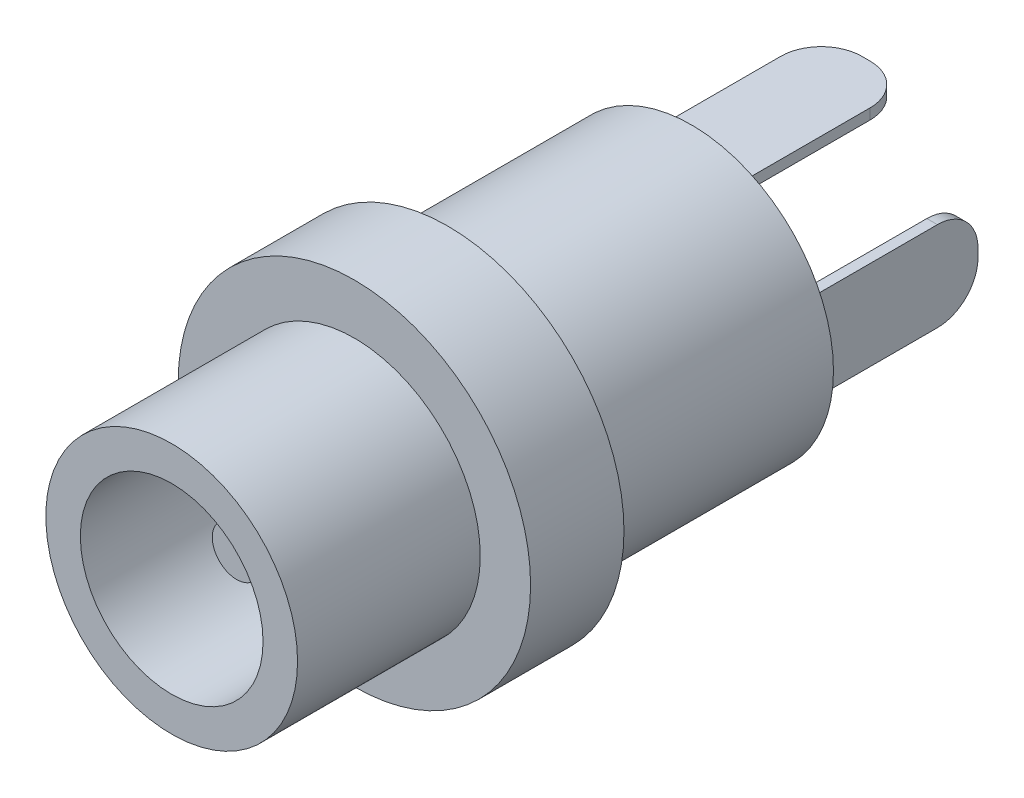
ISO-10303-21;
HEADER;
FILE_DESCRIPTION(('STEP AP214'),'2;1');
FILE_NAME('part.step','',(''),(''),'','','');
FILE_SCHEMA(('AUTOMOTIVE_DESIGN { 1 0 10303 214 1 1 1 1 }'));
ENDSEC;
DATA;
#1=APPLICATION_CONTEXT('core data for automotive mechanical design processes');
#2=APPLICATION_PROTOCOL_DEFINITION('international standard','automotive_design',2000,#1);
#3=PRODUCT_CONTEXT('',#1,'mechanical');
#4=PRODUCT('Part','Part','',(#3));
#5=PRODUCT_RELATED_PRODUCT_CATEGORY('part','',(#4));
#6=PRODUCT_DEFINITION_FORMATION('','',#4);
#7=PRODUCT_DEFINITION_CONTEXT('part definition',#1,'design');
#8=PRODUCT_DEFINITION('design','',#6,#7);
#9=PRODUCT_DEFINITION_SHAPE('','',#8);
#10=(LENGTH_UNIT() NAMED_UNIT(*) SI_UNIT(.MILLI.,.METRE.));
#11=(NAMED_UNIT(*) PLANE_ANGLE_UNIT() SI_UNIT($,.RADIAN.));
#12=(NAMED_UNIT(*) SI_UNIT($,.STERADIAN.) SOLID_ANGLE_UNIT());
#13=UNCERTAINTY_MEASURE_WITH_UNIT(LENGTH_MEASURE(1.E-05),#10,'distance_accuracy_value','');
#14=(GEOMETRIC_REPRESENTATION_CONTEXT(3) GLOBAL_UNCERTAINTY_ASSIGNED_CONTEXT((#13)) GLOBAL_UNIT_ASSIGNED_CONTEXT((#10,
#11,#12)) REPRESENTATION_CONTEXT('',''));
#15=CARTESIAN_POINT('',(0.,0.,0.));
#16=DIRECTION('',(0.,0.,1.));
#17=DIRECTION('',(1.,0.,0.));
#18=AXIS2_PLACEMENT_3D('',#15,#16,#17);
#19=CARTESIAN_POINT('',(0.,0.,3.175));
#20=DIRECTION('',(0.,0.,1.));
#21=DIRECTION('',(1.,0.,0.));
#22=AXIS2_PLACEMENT_3D('',#19,#20,#21);
#23=PLANE('',#22);
#24=CARTESIAN_POINT('',(0.,0.,3.175));
#25=DIRECTION('',(0.,0.,1.));
#26=DIRECTION('',(1.,0.,0.));
#27=AXIS2_PLACEMENT_3D('',#24,#25,#26);
#28=CIRCLE('',#27,2.8575);
#29=CARTESIAN_POINT('',(2.8575,0.,3.175));
#30=VERTEX_POINT('',#29);
#31=EDGE_CURVE('E179',#30,#30,#28,.T.);
#32=ORIENTED_EDGE('',*,*,#31,.T.);
#33=EDGE_LOOP('',(#32));
#34=FACE_BOUND('',#33,.T.);
#35=CARTESIAN_POINT('',(0.,0.,3.175));
#36=DIRECTION('',(0.,0.,1.));
#37=DIRECTION('',(1.,0.,0.));
#38=AXIS2_PLACEMENT_3D('',#35,#36,#37);
#39=CIRCLE('',#38,0.762);
#40=CARTESIAN_POINT('',(0.762,0.,3.175));
#41=VERTEX_POINT('',#40);
#42=EDGE_CURVE('E363',#41,#41,#39,.T.);
#43=ORIENTED_EDGE('',*,*,#42,.F.);
#44=EDGE_LOOP('',(#43));
#45=FACE_BOUND('',#44,.T.);
#46=ADVANCED_FACE('F34',(#34,#45),#23,.T.);
#47=CARTESIAN_POINT('',(0.,0.,-7.62));
#48=DIRECTION('',(0.,0.,-1.));
#49=DIRECTION('',(-1.,0.,0.));
#50=AXIS2_PLACEMENT_3D('',#47,#48,#49);
#51=PLANE('',#50);
#52=DIRECTION('',(-1.,0.,0.));
#53=VECTOR('',#52,1.);
#54=CARTESIAN_POINT('',(-3.17499999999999,-1.39700000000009,-7.61999999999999));
#55=LINE('',#54,#53);
#56=CARTESIAN_POINT('',(-3.17499999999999,-1.39700000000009,-7.61999999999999));
#57=VERTEX_POINT('',#56);
#58=CARTESIAN_POINT('',(-3.50519999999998,-1.39700000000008,-7.62));
#59=VERTEX_POINT('',#58);
#60=EDGE_CURVE('E202',#57,#59,#55,.T.);
#61=ORIENTED_EDGE('',*,*,#60,.F.);
#62=DIRECTION('',(0.,-1.,0.));
#63=VECTOR('',#62,1.);
#64=CARTESIAN_POINT('',(-3.17499999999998,1.39699999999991,-7.61999999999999));
#65=LINE('',#64,#63);
#66=CARTESIAN_POINT('',(-3.17499999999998,1.39699999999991,-7.61999999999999));
#67=VERTEX_POINT('',#66);
#68=EDGE_CURVE('E168',#67,#57,#65,.T.);
#69=ORIENTED_EDGE('',*,*,#68,.F.);
#70=DIRECTION('',(1.,0.,0.));
#71=VECTOR('',#70,1.);
#72=CARTESIAN_POINT('',(-3.17499999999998,1.39699999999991,-7.61999999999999));
#73=LINE('',#72,#71);
#74=CARTESIAN_POINT('',(-3.50519999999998,1.39699999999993,-7.62));
#75=VERTEX_POINT('',#74);
#76=EDGE_CURVE('E208',#75,#67,#73,.T.);
#77=ORIENTED_EDGE('',*,*,#76,.F.);
#78=DIRECTION('',(0.,1.,0.));
#79=VECTOR('',#78,1.);
#80=CARTESIAN_POINT('',(-3.50519999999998,1.39699999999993,-7.62));
#81=LINE('',#80,#79);
#82=EDGE_CURVE('E205',#59,#75,#81,.T.);
#83=ORIENTED_EDGE('',*,*,#82,.F.);
#84=EDGE_LOOP('',(#61,#69,#77,#83));
#85=FACE_BOUND('',#84,.T.);
#86=CARTESIAN_POINT('',(0.,0.,-7.62));
#87=DIRECTION('',(0.,0.,-1.));
#88=DIRECTION('',(-1.,0.,0.));
#89=AXIS2_PLACEMENT_3D('',#86,#87,#88);
#90=CIRCLE('',#89,4.445);
#91=CARTESIAN_POINT('',(4.445,0.,-7.62));
#92=VERTEX_POINT('',#91);
#93=EDGE_CURVE('E251',#92,#92,#90,.T.);
#94=ORIENTED_EDGE('',*,*,#93,.T.);
#95=EDGE_LOOP('',(#94));
#96=FACE_BOUND('',#95,.T.);
#97=DIRECTION('',(-1.,0.,0.));
#98=VECTOR('',#97,1.);
#99=CARTESIAN_POINT('',(1.39700000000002,3.175,-7.61999999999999));
#100=LINE('',#99,#98);
#101=CARTESIAN_POINT('',(1.39700000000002,3.175,-7.61999999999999));
#102=VERTEX_POINT('',#101);
#103=CARTESIAN_POINT('',(-1.397,3.175,-7.62));
#104=VERTEX_POINT('',#103);
#105=EDGE_CURVE('E228',#102,#104,#100,.T.);
#106=ORIENTED_EDGE('',*,*,#105,.F.);
#107=DIRECTION('',(0.,-1.,0.));
#108=VECTOR('',#107,1.);
#109=CARTESIAN_POINT('',(1.397,3.50520000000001,-7.61999999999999));
#110=LINE('',#109,#108);
#111=CARTESIAN_POINT('',(1.397,3.50520000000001,-7.61999999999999));
#112=VERTEX_POINT('',#111);
#113=EDGE_CURVE('E225',#112,#102,#110,.T.);
#114=ORIENTED_EDGE('',*,*,#113,.F.);
#115=DIRECTION('',(1.,0.,0.));
#116=VECTOR('',#115,1.);
#117=CARTESIAN_POINT('',(1.397,3.50520000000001,-7.61999999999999));
#118=LINE('',#117,#116);
#119=CARTESIAN_POINT('',(-1.39699999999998,3.50520000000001,-7.62));
#120=VERTEX_POINT('',#119);
#121=EDGE_CURVE('E234',#120,#112,#118,.T.);
#122=ORIENTED_EDGE('',*,*,#121,.F.);
#123=DIRECTION('',(0.,1.,0.));
#124=VECTOR('',#123,1.);
#125=CARTESIAN_POINT('',(-1.39699999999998,3.50520000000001,-7.62));
#126=LINE('',#125,#124);
#127=EDGE_CURVE('E231',#104,#120,#126,.T.);
#128=ORIENTED_EDGE('',*,*,#127,.F.);
#129=EDGE_LOOP('',(#106,#114,#122,#128));
#130=FACE_BOUND('',#129,.T.);
#131=DIRECTION('',(1.,0.,0.));
#132=VECTOR('',#131,1.);
#133=CARTESIAN_POINT('',(3.17500000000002,1.397,-7.62));
#134=LINE('',#133,#132);
#135=CARTESIAN_POINT('',(3.17500000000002,1.397,-7.62));
#136=VERTEX_POINT('',#135);
#137=CARTESIAN_POINT('',(3.50520000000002,1.397,-7.62));
#138=VERTEX_POINT('',#137);
#139=EDGE_CURVE('E163',#136,#138,#134,.T.);
#140=ORIENTED_EDGE('',*,*,#139,.F.);
#141=DIRECTION('',(0.,1.,0.));
#142=VECTOR('',#141,1.);
#143=CARTESIAN_POINT('',(3.17500000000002,1.397,-7.62));
#144=LINE('',#143,#142);
#145=CARTESIAN_POINT('',(3.17500000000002,-1.397,-7.62));
#146=VERTEX_POINT('',#145);
#147=EDGE_CURVE('E172',#146,#136,#144,.T.);
#148=ORIENTED_EDGE('',*,*,#147,.F.);
#149=DIRECTION('',(-1.,0.,0.));
#150=VECTOR('',#149,1.);
#151=CARTESIAN_POINT('',(3.17500000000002,-1.397,-7.62));
#152=LINE('',#151,#150);
#153=CARTESIAN_POINT('',(3.5052,-1.397,-7.62));
#154=VERTEX_POINT('',#153);
#155=EDGE_CURVE('E185',#154,#146,#152,.T.);
#156=ORIENTED_EDGE('',*,*,#155,.F.);
#157=DIRECTION('',(0.,-1.,0.));
#158=VECTOR('',#157,1.);
#159=CARTESIAN_POINT('',(3.50520000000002,1.397,-7.62));
#160=LINE('',#159,#158);
#161=EDGE_CURVE('E183',#138,#154,#160,.T.);
#162=ORIENTED_EDGE('',*,*,#161,.F.);
#163=EDGE_LOOP('',(#140,#148,#156,#162));
#164=FACE_BOUND('',#163,.T.);
#165=ADVANCED_FACE('F181',(#85,#96,#130,#164),#51,.T.);
#166=CARTESIAN_POINT('',(0.,0.,0.));
#167=DIRECTION('',(0.,0.,1.));
#168=DIRECTION('',(1.,0.,0.));
#169=AXIS2_PLACEMENT_3D('',#166,#167,#168);
#170=PLANE('',#169);
#171=CARTESIAN_POINT('',(0.,0.,0.));
#172=DIRECTION('',(0.,0.,1.));
#173=DIRECTION('',(1.,0.,0.));
#174=AXIS2_PLACEMENT_3D('',#171,#172,#173);
#175=CIRCLE('',#174,5.5118);
#176=CARTESIAN_POINT('',(5.5118,0.,0.));
#177=VERTEX_POINT('',#176);
#178=EDGE_CURVE('E260',#177,#177,#175,.T.);
#179=ORIENTED_EDGE('',*,*,#178,.F.);
#180=EDGE_LOOP('',(#179));
#181=FACE_BOUND('',#180,.T.);
#182=CARTESIAN_POINT('',(0.,0.,0.));
#183=DIRECTION('',(0.,0.,1.));
#184=DIRECTION('',(1.,0.,0.));
#185=AXIS2_PLACEMENT_3D('',#182,#183,#184);
#186=CIRCLE('',#185,4.445);
#187=CARTESIAN_POINT('',(4.445,0.,0.));
#188=VERTEX_POINT('',#187);
#189=EDGE_CURVE('E266',#188,#188,#186,.F.);
#190=ORIENTED_EDGE('',*,*,#189,.F.);
#191=EDGE_LOOP('',(#190));
#192=FACE_BOUND('',#191,.T.);
#193=ADVANCED_FACE('F345',(#181,#192),#170,.F.);
#194=CARTESIAN_POINT('',(0.,0.,2.92100000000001));
#195=DIRECTION('',(0.,0.,1.));
#196=DIRECTION('',(1.,0.,0.));
#197=AXIS2_PLACEMENT_3D('',#194,#195,#196);
#198=PLANE('',#197);
#199=CARTESIAN_POINT('',(0.,0.,2.92100000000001));
#200=DIRECTION('',(0.,0.,1.));
#201=DIRECTION('',(1.,0.,0.));
#202=AXIS2_PLACEMENT_3D('',#199,#200,#201);
#203=CIRCLE('',#202,5.5118);
#204=CARTESIAN_POINT('',(5.5118,0.,2.92100000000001));
#205=VERTEX_POINT('',#204);
#206=EDGE_CURVE('E263',#205,#205,#203,.T.);
#207=ORIENTED_EDGE('',*,*,#206,.T.);
#208=EDGE_LOOP('',(#207));
#209=FACE_BOUND('',#208,.T.);
#210=CARTESIAN_POINT('',(0.,0.,2.92100000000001));
#211=DIRECTION('',(0.,0.,1.));
#212=DIRECTION('',(1.,0.,0.));
#213=AXIS2_PLACEMENT_3D('',#210,#211,#212);
#214=CIRCLE('',#213,3.937);
#215=CARTESIAN_POINT('',(3.937,0.,2.92100000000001));
#216=VERTEX_POINT('',#215);
#217=EDGE_CURVE('E254',#216,#216,#214,.T.);
#218=ORIENTED_EDGE('',*,*,#217,.F.);
#219=EDGE_LOOP('',(#218));
#220=FACE_BOUND('',#219,.T.);
#221=ADVANCED_FACE('F386',(#209,#220),#198,.T.);
#222=CARTESIAN_POINT('',(0.,0.,2.92100000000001));
#223=DIRECTION('',(0.,0.,-1.));
#224=DIRECTION('',(-1.,0.,0.));
#225=AXIS2_PLACEMENT_3D('',#222,#223,#224);
#226=CYLINDRICAL_SURFACE('',#225,5.5118);
#227=ORIENTED_EDGE('',*,*,#206,.F.);
#228=EDGE_LOOP('',(#227));
#229=FACE_BOUND('',#228,.T.);
#230=ORIENTED_EDGE('',*,*,#178,.T.);
#231=EDGE_LOOP('',(#230));
#232=FACE_BOUND('',#231,.T.);
#233=ADVANCED_FACE('F36',(#229,#232),#226,.T.);
#234=CARTESIAN_POINT('',(0.,0.,8.636));
#235=DIRECTION('',(0.,0.,-1.));
#236=DIRECTION('',(-1.,0.,0.));
#237=AXIS2_PLACEMENT_3D('',#234,#235,#236);
#238=CYLINDRICAL_SURFACE('',#237,3.937);
#239=CARTESIAN_POINT('',(0.,0.,8.636));
#240=DIRECTION('',(0.,0.,1.));
#241=DIRECTION('',(1.,0.,0.));
#242=AXIS2_PLACEMENT_3D('',#239,#240,#241);
#243=CIRCLE('',#242,3.937);
#244=CARTESIAN_POINT('',(3.937,0.,8.636));
#245=VERTEX_POINT('',#244);
#246=EDGE_CURVE('E257',#245,#245,#243,.T.);
#247=ORIENTED_EDGE('',*,*,#246,.F.);
#248=EDGE_LOOP('',(#247));
#249=FACE_BOUND('',#248,.T.);
#250=ORIENTED_EDGE('',*,*,#217,.T.);
#251=EDGE_LOOP('',(#250));
#252=FACE_BOUND('',#251,.T.);
#253=ADVANCED_FACE('F377',(#249,#252),#238,.T.);
#254=CARTESIAN_POINT('',(0.,0.,8.636));
#255=DIRECTION('',(0.,0.,1.));
#256=DIRECTION('',(1.,0.,0.));
#257=AXIS2_PLACEMENT_3D('',#254,#255,#256);
#258=PLANE('',#257);
#259=CARTESIAN_POINT('',(0.,0.,8.636));
#260=DIRECTION('',(0.,0.,1.));
#261=DIRECTION('',(1.,0.,0.));
#262=AXIS2_PLACEMENT_3D('',#259,#260,#261);
#263=CIRCLE('',#262,2.8575);
#264=CARTESIAN_POINT('',(2.8575,0.,8.636));
#265=VERTEX_POINT('',#264);
#266=EDGE_CURVE('E362',#265,#265,#263,.T.);
#267=ORIENTED_EDGE('',*,*,#266,.F.);
#268=EDGE_LOOP('',(#267));
#269=FACE_BOUND('',#268,.T.);
#270=ORIENTED_EDGE('',*,*,#246,.T.);
#271=EDGE_LOOP('',(#270));
#272=FACE_BOUND('',#271,.T.);
#273=ADVANCED_FACE('F373',(#269,#272),#258,.T.);
#274=CARTESIAN_POINT('',(0.,0.,-7.62));
#275=DIRECTION('',(0.,0.,1.));
#276=DIRECTION('',(1.,0.,0.));
#277=AXIS2_PLACEMENT_3D('',#274,#275,#276);
#278=CYLINDRICAL_SURFACE('',#277,4.445);
#279=CARTESIAN_POINT('',(4.445,0.,-7.62));
#280=CARTESIAN_POINT('',(4.445,0.,-7.540625));
#281=CARTESIAN_POINT('',(4.445,0.,-7.46125));
#282=CARTESIAN_POINT('',(4.445,0.,-7.3025));
#283=CARTESIAN_POINT('',(4.445,0.,-7.223125));
#284=CARTESIAN_POINT('',(4.445,0.,-7.064375));
#285=CARTESIAN_POINT('',(4.445,0.,-6.985));
#286=CARTESIAN_POINT('',(4.445,0.,-6.82625));
#287=CARTESIAN_POINT('',(4.445,0.,-6.746875));
#288=CARTESIAN_POINT('',(4.445,0.,-6.588125));
#289=CARTESIAN_POINT('',(4.445,0.,-6.50875));
#290=CARTESIAN_POINT('',(4.445,0.,-6.35));
#291=CARTESIAN_POINT('',(4.445,0.,-6.270625));
#292=CARTESIAN_POINT('',(4.445,0.,-6.111875));
#293=CARTESIAN_POINT('',(4.445,0.,-6.0325));
#294=CARTESIAN_POINT('',(4.445,0.,-5.87375));
#295=CARTESIAN_POINT('',(4.445,0.,-5.794375));
#296=CARTESIAN_POINT('',(4.445,0.,-5.635625));
#297=CARTESIAN_POINT('',(4.445,0.,-5.55625));
#298=CARTESIAN_POINT('',(4.445,0.,-5.3975));
#299=CARTESIAN_POINT('',(4.445,0.,-5.318125));
#300=CARTESIAN_POINT('',(4.445,0.,-5.159375));
#301=CARTESIAN_POINT('',(4.445,0.,-5.08));
#302=CARTESIAN_POINT('',(4.445,0.,-4.92125));
#303=CARTESIAN_POINT('',(4.445,0.,-4.841875));
#304=CARTESIAN_POINT('',(4.445,0.,-4.683125));
#305=CARTESIAN_POINT('',(4.445,0.,-4.60375));
#306=CARTESIAN_POINT('',(4.445,0.,-4.445));
#307=CARTESIAN_POINT('',(4.445,0.,-4.365625));
#308=CARTESIAN_POINT('',(4.445,0.,-4.206875));
#309=CARTESIAN_POINT('',(4.445,0.,-4.1275));
#310=CARTESIAN_POINT('',(4.445,0.,-3.96875));
#311=CARTESIAN_POINT('',(4.445,0.,-3.889375));
#312=CARTESIAN_POINT('',(4.445,0.,-3.730625));
#313=CARTESIAN_POINT('',(4.445,0.,-3.65125));
#314=CARTESIAN_POINT('',(4.445,0.,-3.4925));
#315=CARTESIAN_POINT('',(4.445,0.,-3.413125));
#316=CARTESIAN_POINT('',(4.445,0.,-3.254375));
#317=CARTESIAN_POINT('',(4.445,0.,-3.175));
#318=CARTESIAN_POINT('',(4.445,0.,-3.01625));
#319=CARTESIAN_POINT('',(4.445,0.,-2.936875));
#320=CARTESIAN_POINT('',(4.445,0.,-2.778125));
#321=CARTESIAN_POINT('',(4.445,0.,-2.69875));
#322=CARTESIAN_POINT('',(4.445,0.,-2.54));
#323=CARTESIAN_POINT('',(4.445,0.,-2.460625));
#324=CARTESIAN_POINT('',(4.445,0.,-2.301875));
#325=CARTESIAN_POINT('',(4.445,0.,-2.2225));
#326=CARTESIAN_POINT('',(4.445,0.,-2.06375));
#327=CARTESIAN_POINT('',(4.445,0.,-1.984375));
#328=CARTESIAN_POINT('',(4.445,0.,-1.825625));
#329=CARTESIAN_POINT('',(4.445,0.,-1.74625));
#330=CARTESIAN_POINT('',(4.445,0.,-1.5875));
#331=CARTESIAN_POINT('',(4.445,0.,-1.508125));
#332=CARTESIAN_POINT('',(4.445,0.,-1.349375));
#333=CARTESIAN_POINT('',(4.445,0.,-1.27));
#334=CARTESIAN_POINT('',(4.445,0.,-1.11125));
#335=CARTESIAN_POINT('',(4.445,0.,-1.031875));
#336=CARTESIAN_POINT('',(4.445,0.,-0.873125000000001));
#337=CARTESIAN_POINT('',(4.445,0.,-0.793750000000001));
#338=CARTESIAN_POINT('',(4.445,0.,-0.635000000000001));
#339=CARTESIAN_POINT('',(4.445,0.,-0.555625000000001));
#340=CARTESIAN_POINT('',(4.445,0.,-0.396875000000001));
#341=CARTESIAN_POINT('',(4.445,0.,-0.317500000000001));
#342=CARTESIAN_POINT('',(4.445,0.,-0.158750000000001));
#343=CARTESIAN_POINT('',(4.445,0.,-0.0793750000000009));
#344=CARTESIAN_POINT('',(4.445,0.,0.));
#345=B_SPLINE_CURVE_WITH_KNOTS('',3,(#279,#280,#281,#282,#283,#284,#285,#286,#287,#288,#289,
#290,#291,#292,#293,#294,#295,#296,#297,#298,#299,#300,#301,#302,#303,#304,#305,#306,#307,#308,
#309,#310,#311,#312,#313,#314,#315,#316,#317,#318,#319,#320,#321,#322,#323,#324,#325,#326,#327,
#328,#329,#330,#331,#332,#333,#334,#335,#336,#337,#338,#339,#340,#341,#342,#343,#344),
.UNSPECIFIED.,.F.,.F.,(4,2,2,2,2,2,2,2,2,2,2,2,2,2,2,2,2,2,2,2,2,2,2,2,2,2,2,2,2,2,2,2,4),(0.,
0.238125,0.47625,0.714375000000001,0.9525,1.190625,1.42875,1.666875,1.905,2.143125,2.38125,
2.619375,2.8575,3.095625,3.33375,3.571875,3.81,4.048125,4.28625,4.524375,4.7625,5.000625,
5.23875,5.476875,5.715,5.953125,6.19125,6.429375,6.6675,6.905625,7.14375,7.381875,7.62),.UNSPECIFIED.);
#346=EDGE_CURVE('BSEAM376',#92,#188,#345,.T.);
#347=ORIENTED_EDGE('',*,*,#93,.F.);
#348=ORIENTED_EDGE('',*,*,#189,.T.);
#349=ORIENTED_EDGE('',*,*,#346,.T.);
#350=ORIENTED_EDGE('',*,*,#346,.F.);
#351=EDGE_LOOP('',(#347,#349,#348,#350));
#352=FACE_BOUND('',#351,.T.);
#353=ADVANCED_FACE('F376',(#352),#278,.T.);
#354=CARTESIAN_POINT('',(1.397,3.50520000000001,-13.081));
#355=DIRECTION('',(-1.,0.,0.));
#356=DIRECTION('',(0.,0.,1.));
#357=AXIS2_PLACEMENT_3D('',#354,#355,#356);
#358=PLANE('',#357);
#359=DIRECTION('',(0.,0.,1.));
#360=VECTOR('',#359,1.);
#361=CARTESIAN_POINT('',(1.39700000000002,3.175,-13.081));
#362=LINE('',#361,#360);
#363=CARTESIAN_POINT('',(1.39700000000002,3.175,-11.811));
#364=VERTEX_POINT('',#363);
#365=EDGE_CURVE('E249',#364,#102,#362,.T.);
#366=ORIENTED_EDGE('',*,*,#365,.F.);
#367=DIRECTION('',(0.,-1.,0.));
#368=VECTOR('',#367,1.);
#369=CARTESIAN_POINT('',(1.397,3.50520000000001,-11.811));
#370=LINE('',#369,#368);
#371=CARTESIAN_POINT('',(1.397,3.50520000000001,-11.811));
#372=VERTEX_POINT('',#371);
#373=EDGE_CURVE('E279',#364,#372,#370,.F.);
#374=ORIENTED_EDGE('',*,*,#373,.T.);
#375=DIRECTION('',(0.,0.,1.));
#376=VECTOR('',#375,1.);
#377=CARTESIAN_POINT('',(1.397,3.50520000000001,-13.081));
#378=LINE('',#377,#376);
#379=EDGE_CURVE('E243',#372,#112,#378,.T.);
#380=ORIENTED_EDGE('',*,*,#379,.T.);
#381=ORIENTED_EDGE('',*,*,#113,.T.);
#382=EDGE_LOOP('',(#366,#374,#380,#381));
#383=FACE_BOUND('',#382,.T.);
#384=ADVANCED_FACE('F398',(#383),#358,.F.);
#385=CARTESIAN_POINT('',(1.39700000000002,3.175,-13.081));
#386=DIRECTION('',(0.,1.,0.));
#387=DIRECTION('',(-1.,0.,0.));
#388=AXIS2_PLACEMENT_3D('',#385,#386,#387);
#389=PLANE('',#388);
#390=DIRECTION('',(-1.,0.,0.));
#391=VECTOR('',#390,1.);
#392=CARTESIAN_POINT('',(1.39700000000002,3.175,-13.081));
#393=LINE('',#392,#391);
#394=CARTESIAN_POINT('',(0.127000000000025,3.17499999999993,-13.081));
#395=VERTEX_POINT('',#394);
#396=CARTESIAN_POINT('',(-0.12699999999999,3.17499999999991,-13.081));
#397=VERTEX_POINT('',#396);
#398=EDGE_CURVE('E237',#395,#397,#393,.T.);
#399=ORIENTED_EDGE('',*,*,#398,.F.);
#400=CARTESIAN_POINT('',(0.127000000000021,3.17499999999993,-11.811));
#401=DIRECTION('',(0.,1.,0.));
#402=DIRECTION('',(-1.,0.,0.));
#403=AXIS2_PLACEMENT_3D('',#400,#401,#402);
#404=CIRCLE('',#403,1.27);
#405=EDGE_CURVE('E277',#395,#364,#404,.F.);
#406=ORIENTED_EDGE('',*,*,#405,.T.);
#407=ORIENTED_EDGE('',*,*,#365,.T.);
#408=ORIENTED_EDGE('',*,*,#105,.T.);
#409=DIRECTION('',(0.,0.,1.));
#410=VECTOR('',#409,1.);
#411=CARTESIAN_POINT('',(-1.397,3.175,-13.081));
#412=LINE('',#411,#410);
#413=CARTESIAN_POINT('',(-1.397,3.175,-11.811));
#414=VERTEX_POINT('',#413);
#415=EDGE_CURVE('E247',#414,#104,#412,.T.);
#416=ORIENTED_EDGE('',*,*,#415,.F.);
#417=CARTESIAN_POINT('',(-0.12699999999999,3.17499999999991,-11.811));
#418=DIRECTION('',(0.,1.,0.));
#419=DIRECTION('',(-1.,0.,0.));
#420=AXIS2_PLACEMENT_3D('',#417,#418,#419);
#421=CIRCLE('',#420,1.27);
#422=EDGE_CURVE('E275',#414,#397,#421,.F.);
#423=ORIENTED_EDGE('',*,*,#422,.T.);
#424=EDGE_LOOP('',(#399,#406,#407,#408,#416,#423));
#425=FACE_BOUND('',#424,.T.);
#426=ADVANCED_FACE('F403',(#425),#389,.F.);
#427=CARTESIAN_POINT('',(-1.39699999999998,3.50520000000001,-13.081));
#428=DIRECTION('',(1.,0.,0.));
#429=DIRECTION('',(0.,0.,-1.));
#430=AXIS2_PLACEMENT_3D('',#427,#428,#429);
#431=PLANE('',#430);
#432=DIRECTION('',(0.,0.,1.));
#433=VECTOR('',#432,1.);
#434=CARTESIAN_POINT('',(-1.39699999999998,3.50520000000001,-13.081));
#435=LINE('',#434,#433);
#436=CARTESIAN_POINT('',(-1.39699999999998,3.50520000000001,-11.811));
#437=VERTEX_POINT('',#436);
#438=EDGE_CURVE('E245',#437,#120,#435,.T.);
#439=ORIENTED_EDGE('',*,*,#438,.F.);
#440=DIRECTION('',(0.,1.,0.));
#441=VECTOR('',#440,1.);
#442=CARTESIAN_POINT('',(-1.397,3.175,-11.811));
#443=LINE('',#442,#441);
#444=EDGE_CURVE('E285',#437,#414,#443,.F.);
#445=ORIENTED_EDGE('',*,*,#444,.T.);
#446=ORIENTED_EDGE('',*,*,#415,.T.);
#447=ORIENTED_EDGE('',*,*,#127,.T.);
#448=EDGE_LOOP('',(#439,#445,#446,#447));
#449=FACE_BOUND('',#448,.T.);
#450=ADVANCED_FACE('F407',(#449),#431,.F.);
#451=CARTESIAN_POINT('',(1.397,3.50520000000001,-13.081));
#452=DIRECTION('',(0.,-1.,0.));
#453=DIRECTION('',(1.,0.,0.));
#454=AXIS2_PLACEMENT_3D('',#451,#452,#453);
#455=PLANE('',#454);
#456=ORIENTED_EDGE('',*,*,#379,.F.);
#457=CARTESIAN_POINT('',(0.127000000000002,3.5052,-11.811));
#458=DIRECTION('',(0.,-1.,0.));
#459=DIRECTION('',(1.,0.,0.));
#460=AXIS2_PLACEMENT_3D('',#457,#458,#459);
#461=CIRCLE('',#460,1.27);
#462=CARTESIAN_POINT('',(0.127000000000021,3.5052,-13.081));
#463=VERTEX_POINT('',#462);
#464=EDGE_CURVE('E283',#372,#463,#461,.F.);
#465=ORIENTED_EDGE('',*,*,#464,.T.);
#466=DIRECTION('',(1.,0.,0.));
#467=VECTOR('',#466,1.);
#468=CARTESIAN_POINT('',(1.397,3.50520000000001,-13.081));
#469=LINE('',#468,#467);
#470=CARTESIAN_POINT('',(-0.126999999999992,3.50519999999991,-13.081));
#471=VERTEX_POINT('',#470);
#472=EDGE_CURVE('E240',#471,#463,#469,.T.);
#473=ORIENTED_EDGE('',*,*,#472,.F.);
#474=CARTESIAN_POINT('',(-0.126999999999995,3.50519999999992,-11.811));
#475=DIRECTION('',(0.,-1.,0.));
#476=DIRECTION('',(1.,0.,0.));
#477=AXIS2_PLACEMENT_3D('',#474,#475,#476);
#478=CIRCLE('',#477,1.27);
#479=EDGE_CURVE('E281',#471,#437,#478,.F.);
#480=ORIENTED_EDGE('',*,*,#479,.T.);
#481=ORIENTED_EDGE('',*,*,#438,.T.);
#482=ORIENTED_EDGE('',*,*,#121,.T.);
#483=EDGE_LOOP('',(#456,#465,#473,#480,#481,#482));
#484=FACE_BOUND('',#483,.T.);
#485=ADVANCED_FACE('F411',(#484),#455,.F.);
#486=CARTESIAN_POINT('',(1.39700000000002,3.175,-13.081));
#487=DIRECTION('',(0.,0.,-1.));
#488=DIRECTION('',(-1.,0.,0.));
#489=AXIS2_PLACEMENT_3D('',#486,#487,#488);
#490=PLANE('',#489);
#491=ORIENTED_EDGE('',*,*,#472,.T.);
#492=DIRECTION('',(0.,-1.,0.));
#493=VECTOR('',#492,1.);
#494=CARTESIAN_POINT('',(0.127000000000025,3.17499999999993,-13.081));
#495=LINE('',#494,#493);
#496=EDGE_CURVE('E272',#463,#395,#495,.T.);
#497=ORIENTED_EDGE('',*,*,#496,.T.);
#498=ORIENTED_EDGE('',*,*,#398,.T.);
#499=DIRECTION('',(0.,1.,0.));
#500=VECTOR('',#499,1.);
#501=CARTESIAN_POINT('',(-0.126999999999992,3.50519999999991,-13.081));
#502=LINE('',#501,#500);
#503=EDGE_CURVE('E269',#397,#471,#502,.T.);
#504=ORIENTED_EDGE('',*,*,#503,.T.);
#505=EDGE_LOOP('',(#491,#497,#498,#504));
#506=FACE_BOUND('',#505,.T.);
#507=ADVANCED_FACE('F415',(#506),#490,.T.);
#508=CARTESIAN_POINT('',(-3.17499999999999,1.39699999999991,-13.081));
#509=DIRECTION('',(-1.,0.,0.));
#510=DIRECTION('',(0.,-1.,0.));
#511=AXIS2_PLACEMENT_3D('',#508,#509,#510);
#512=PLANE('',#511);
#513=DIRECTION('',(0.,-1.,0.));
#514=VECTOR('',#513,1.);
#515=CARTESIAN_POINT('',(-3.17499999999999,1.39699999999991,-13.081));
#516=LINE('',#515,#514);
#517=CARTESIAN_POINT('',(-3.17499999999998,0.127000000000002,-13.081));
#518=VERTEX_POINT('',#517);
#519=CARTESIAN_POINT('',(-3.17499999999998,-0.126999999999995,-13.081));
#520=VERTEX_POINT('',#519);
#521=EDGE_CURVE('E211',#518,#520,#516,.T.);
#522=ORIENTED_EDGE('',*,*,#521,.F.);
#523=CARTESIAN_POINT('',(-3.17499999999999,0.127000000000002,-11.811));
#524=DIRECTION('',(-1.,0.,0.));
#525=DIRECTION('',(0.,-1.,0.));
#526=AXIS2_PLACEMENT_3D('',#523,#524,#525);
#527=CIRCLE('',#526,1.27);
#528=CARTESIAN_POINT('',(-3.17499999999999,1.39699999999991,-11.811));
#529=VERTEX_POINT('',#528);
#530=EDGE_CURVE('E295',#518,#529,#527,.F.);
#531=ORIENTED_EDGE('',*,*,#530,.T.);
#532=DIRECTION('',(0.,0.,1.));
#533=VECTOR('',#532,1.);
#534=CARTESIAN_POINT('',(-3.17499999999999,1.39699999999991,-13.081));
#535=LINE('',#534,#533);
#536=EDGE_CURVE('E217',#529,#67,#535,.T.);
#537=ORIENTED_EDGE('',*,*,#536,.T.);
#538=ORIENTED_EDGE('',*,*,#68,.T.);
#539=DIRECTION('',(0.,0.,1.));
#540=VECTOR('',#539,1.);
#541=CARTESIAN_POINT('',(-3.17499999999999,-1.39700000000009,-13.081));
#542=LINE('',#541,#540);
#543=CARTESIAN_POINT('',(-3.175,-1.39700000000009,-11.811));
#544=VERTEX_POINT('',#543);
#545=EDGE_CURVE('E223',#544,#57,#542,.T.);
#546=ORIENTED_EDGE('',*,*,#545,.F.);
#547=CARTESIAN_POINT('',(-3.17499999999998,-0.126999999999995,-11.811));
#548=DIRECTION('',(-1.,0.,0.));
#549=DIRECTION('',(0.,-1.,0.));
#550=AXIS2_PLACEMENT_3D('',#547,#548,#549);
#551=CIRCLE('',#550,1.27);
#552=EDGE_CURVE('E293',#544,#520,#551,.F.);
#553=ORIENTED_EDGE('',*,*,#552,.T.);
#554=EDGE_LOOP('',(#522,#531,#537,#538,#546,#553));
#555=FACE_BOUND('',#554,.T.);
#556=ADVANCED_FACE('F419',(#555),#512,.F.);
#557=CARTESIAN_POINT('',(-3.17499999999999,-1.39700000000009,-13.081));
#558=DIRECTION('',(0.,1.,0.));
#559=DIRECTION('',(0.,0.,1.));
#560=AXIS2_PLACEMENT_3D('',#557,#558,#559);
#561=PLANE('',#560);
#562=DIRECTION('',(0.,0.,1.));
#563=VECTOR('',#562,1.);
#564=CARTESIAN_POINT('',(-3.50519999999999,-1.39700000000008,-13.081));
#565=LINE('',#564,#563);
#566=CARTESIAN_POINT('',(-3.50519999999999,-1.39700000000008,-11.811));
#567=VERTEX_POINT('',#566);
#568=EDGE_CURVE('E221',#567,#59,#565,.T.);
#569=ORIENTED_EDGE('',*,*,#568,.F.);
#570=DIRECTION('',(-1.,0.,0.));
#571=VECTOR('',#570,1.);
#572=CARTESIAN_POINT('',(-3.175,-1.39700000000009,-11.811));
#573=LINE('',#572,#571);
#574=EDGE_CURVE('E303',#567,#544,#573,.F.);
#575=ORIENTED_EDGE('',*,*,#574,.T.);
#576=ORIENTED_EDGE('',*,*,#545,.T.);
#577=ORIENTED_EDGE('',*,*,#60,.T.);
#578=EDGE_LOOP('',(#569,#575,#576,#577));
#579=FACE_BOUND('',#578,.T.);
#580=ADVANCED_FACE('F423',(#579),#561,.F.);
#581=CARTESIAN_POINT('',(-3.50519999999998,1.39699999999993,-13.081));
#582=DIRECTION('',(1.,0.,0.));
#583=DIRECTION('',(0.,1.,0.));
#584=AXIS2_PLACEMENT_3D('',#581,#582,#583);
#585=PLANE('',#584);
#586=DIRECTION('',(0.,0.,1.));
#587=VECTOR('',#586,1.);
#588=CARTESIAN_POINT('',(-3.50519999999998,1.39699999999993,-13.081));
#589=LINE('',#588,#587);
#590=CARTESIAN_POINT('',(-3.50519999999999,1.39699999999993,-11.811));
#591=VERTEX_POINT('',#590);
#592=EDGE_CURVE('E219',#591,#75,#589,.T.);
#593=ORIENTED_EDGE('',*,*,#592,.F.);
#594=CARTESIAN_POINT('',(-3.50519999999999,0.127000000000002,-11.811));
#595=DIRECTION('',(1.,0.,0.));
#596=DIRECTION('',(0.,1.,0.));
#597=AXIS2_PLACEMENT_3D('',#594,#595,#596);
#598=CIRCLE('',#597,1.27);
#599=CARTESIAN_POINT('',(-3.50519999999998,0.127000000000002,-13.081));
#600=VERTEX_POINT('',#599);
#601=EDGE_CURVE('E301',#591,#600,#598,.F.);
#602=ORIENTED_EDGE('',*,*,#601,.T.);
#603=DIRECTION('',(0.,1.,0.));
#604=VECTOR('',#603,1.);
#605=CARTESIAN_POINT('',(-3.50519999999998,1.39699999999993,-13.081));
#606=LINE('',#605,#604);
#607=CARTESIAN_POINT('',(-3.5052,-0.127000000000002,-13.081));
#608=VERTEX_POINT('',#607);
#609=EDGE_CURVE('E214',#608,#600,#606,.T.);
#610=ORIENTED_EDGE('',*,*,#609,.F.);
#611=CARTESIAN_POINT('',(-3.5052,-0.127000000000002,-11.811));
#612=DIRECTION('',(1.,0.,0.));
#613=DIRECTION('',(0.,1.,0.));
#614=AXIS2_PLACEMENT_3D('',#611,#612,#613);
#615=CIRCLE('',#614,1.27);
#616=EDGE_CURVE('E299',#608,#567,#615,.F.);
#617=ORIENTED_EDGE('',*,*,#616,.T.);
#618=ORIENTED_EDGE('',*,*,#568,.T.);
#619=ORIENTED_EDGE('',*,*,#82,.T.);
#620=EDGE_LOOP('',(#593,#602,#610,#617,#618,#619));
#621=FACE_BOUND('',#620,.T.);
#622=ADVANCED_FACE('F427',(#621),#585,.F.);
#623=CARTESIAN_POINT('',(-3.17499999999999,1.39699999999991,-13.081));
#624=DIRECTION('',(0.,-1.,0.));
#625=DIRECTION('',(0.,0.,-1.));
#626=AXIS2_PLACEMENT_3D('',#623,#624,#625);
#627=PLANE('',#626);
#628=ORIENTED_EDGE('',*,*,#536,.F.);
#629=DIRECTION('',(1.,0.,0.));
#630=VECTOR('',#629,1.);
#631=CARTESIAN_POINT('',(-3.50519999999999,1.39699999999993,-11.811));
#632=LINE('',#631,#630);
#633=EDGE_CURVE('E297',#529,#591,#632,.F.);
#634=ORIENTED_EDGE('',*,*,#633,.T.);
#635=ORIENTED_EDGE('',*,*,#592,.T.);
#636=ORIENTED_EDGE('',*,*,#76,.T.);
#637=EDGE_LOOP('',(#628,#634,#635,#636));
#638=FACE_BOUND('',#637,.T.);
#639=ADVANCED_FACE('F431',(#638),#627,.F.);
#640=CARTESIAN_POINT('',(-3.17499999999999,-1.39700000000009,-13.081));
#641=DIRECTION('',(0.,0.,-1.));
#642=DIRECTION('',(-1.,0.,0.));
#643=AXIS2_PLACEMENT_3D('',#640,#641,#642);
#644=PLANE('',#643);
#645=ORIENTED_EDGE('',*,*,#609,.T.);
#646=DIRECTION('',(1.,0.,0.));
#647=VECTOR('',#646,1.);
#648=CARTESIAN_POINT('',(-3.17499999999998,0.127000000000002,-13.081));
#649=LINE('',#648,#647);
#650=EDGE_CURVE('E290',#600,#518,#649,.T.);
#651=ORIENTED_EDGE('',*,*,#650,.T.);
#652=ORIENTED_EDGE('',*,*,#521,.T.);
#653=DIRECTION('',(-1.,0.,0.));
#654=VECTOR('',#653,1.);
#655=CARTESIAN_POINT('',(-3.5052,-0.127000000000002,-13.081));
#656=LINE('',#655,#654);
#657=EDGE_CURVE('E287',#520,#608,#656,.T.);
#658=ORIENTED_EDGE('',*,*,#657,.T.);
#659=EDGE_LOOP('',(#645,#651,#652,#658));
#660=FACE_BOUND('',#659,.T.);
#661=ADVANCED_FACE('F435',(#660),#644,.T.);
#662=CARTESIAN_POINT('',(3.17500000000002,1.397,-13.081));
#663=DIRECTION('',(1.,0.,0.));
#664=DIRECTION('',(0.,0.,-1.));
#665=AXIS2_PLACEMENT_3D('',#662,#663,#664);
#666=PLANE('',#665);
#667=DIRECTION('',(0.,1.,0.));
#668=VECTOR('',#667,1.);
#669=CARTESIAN_POINT('',(3.17500000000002,1.397,-13.081));
#670=LINE('',#669,#668);
#671=CARTESIAN_POINT('',(3.175,-0.126999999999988,-13.081));
#672=VERTEX_POINT('',#671);
#673=CARTESIAN_POINT('',(3.17500000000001,0.127000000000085,-13.081));
#674=VERTEX_POINT('',#673);
#675=EDGE_CURVE('E190',#672,#674,#670,.T.);
#676=ORIENTED_EDGE('',*,*,#675,.F.);
#677=CARTESIAN_POINT('',(3.175,-0.126999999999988,-11.811));
#678=DIRECTION('',(1.,0.,0.));
#679=DIRECTION('',(0.,0.,-1.));
#680=AXIS2_PLACEMENT_3D('',#677,#678,#679);
#681=CIRCLE('',#680,1.27);
#682=CARTESIAN_POINT('',(3.17500000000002,-1.397,-11.811));
#683=VERTEX_POINT('',#682);
#684=EDGE_CURVE('E313',#672,#683,#681,.F.);
#685=ORIENTED_EDGE('',*,*,#684,.T.);
#686=DIRECTION('',(0.,0.,1.));
#687=VECTOR('',#686,1.);
#688=CARTESIAN_POINT('',(3.17500000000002,-1.397,-13.081));
#689=LINE('',#688,#687);
#690=EDGE_CURVE('E175',#683,#146,#689,.T.);
#691=ORIENTED_EDGE('',*,*,#690,.T.);
#692=ORIENTED_EDGE('',*,*,#147,.T.);
#693=DIRECTION('',(0.,0.,1.));
#694=VECTOR('',#693,1.);
#695=CARTESIAN_POINT('',(3.17500000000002,1.397,-13.081));
#696=LINE('',#695,#694);
#697=CARTESIAN_POINT('',(3.17500000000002,1.397,-11.811));
#698=VERTEX_POINT('',#697);
#699=EDGE_CURVE('E159',#698,#136,#696,.T.);
#700=ORIENTED_EDGE('',*,*,#699,.F.);
#701=CARTESIAN_POINT('',(3.17500000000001,0.127000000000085,-11.811));
#702=DIRECTION('',(1.,0.,0.));
#703=DIRECTION('',(0.,0.,-1.));
#704=AXIS2_PLACEMENT_3D('',#701,#702,#703);
#705=CIRCLE('',#704,1.27);
#706=EDGE_CURVE('E311',#698,#674,#705,.F.);
#707=ORIENTED_EDGE('',*,*,#706,.T.);
#708=EDGE_LOOP('',(#676,#685,#691,#692,#700,#707));
#709=FACE_BOUND('',#708,.T.);
#710=ADVANCED_FACE('F174',(#709),#666,.F.);
#711=CARTESIAN_POINT('',(3.17500000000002,1.397,-13.081));
#712=DIRECTION('',(0.,-1.,0.));
#713=DIRECTION('',(0.,0.,-1.));
#714=AXIS2_PLACEMENT_3D('',#711,#712,#713);
#715=PLANE('',#714);
#716=DIRECTION('',(0.,0.,1.));
#717=VECTOR('',#716,1.);
#718=CARTESIAN_POINT('',(3.50520000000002,1.397,-13.081));
#719=LINE('',#718,#717);
#720=CARTESIAN_POINT('',(3.50520000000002,1.397,-11.811));
#721=VERTEX_POINT('',#720);
#722=EDGE_CURVE('E169',#721,#138,#719,.T.);
#723=ORIENTED_EDGE('',*,*,#722,.F.);
#724=DIRECTION('',(1.,0.,0.));
#725=VECTOR('',#724,1.);
#726=CARTESIAN_POINT('',(3.17500000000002,1.397,-11.811));
#727=LINE('',#726,#725);
#728=EDGE_CURVE('E11',#721,#698,#727,.F.);
#729=ORIENTED_EDGE('',*,*,#728,.T.);
#730=ORIENTED_EDGE('',*,*,#699,.T.);
#731=ORIENTED_EDGE('',*,*,#139,.T.);
#732=EDGE_LOOP('',(#723,#729,#730,#731));
#733=FACE_BOUND('',#732,.T.);
#734=ADVANCED_FACE('F161',(#733),#715,.F.);
#735=CARTESIAN_POINT('',(3.50520000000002,1.397,-13.081));
#736=DIRECTION('',(-1.,0.,0.));
#737=DIRECTION('',(0.,0.,1.));
#738=AXIS2_PLACEMENT_3D('',#735,#736,#737);
#739=PLANE('',#738);
#740=DIRECTION('',(0.,0.,1.));
#741=VECTOR('',#740,1.);
#742=CARTESIAN_POINT('',(3.5052,-1.397,-13.081));
#743=LINE('',#742,#741);
#744=CARTESIAN_POINT('',(3.5052,-1.397,-11.811));
#745=VERTEX_POINT('',#744);
#746=EDGE_CURVE('E197',#745,#154,#743,.T.);
#747=ORIENTED_EDGE('',*,*,#746,.F.);
#748=CARTESIAN_POINT('',(3.50520000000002,-0.127000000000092,-11.811));
#749=DIRECTION('',(-1.,0.,0.));
#750=DIRECTION('',(0.,0.,1.));
#751=AXIS2_PLACEMENT_3D('',#748,#749,#750);
#752=CIRCLE('',#751,1.27);
#753=CARTESIAN_POINT('',(3.50520000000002,-0.127000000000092,-13.081));
#754=VERTEX_POINT('',#753);
#755=EDGE_CURVE('E42',#745,#754,#752,.F.);
#756=ORIENTED_EDGE('',*,*,#755,.T.);
#757=DIRECTION('',(0.,-1.,0.));
#758=VECTOR('',#757,1.);
#759=CARTESIAN_POINT('',(3.50520000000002,1.397,-13.081));
#760=LINE('',#759,#758);
#761=CARTESIAN_POINT('',(3.50520000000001,0.126999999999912,-13.081));
#762=VERTEX_POINT('',#761);
#763=EDGE_CURVE('E193',#762,#754,#760,.T.);
#764=ORIENTED_EDGE('',*,*,#763,.F.);
#765=CARTESIAN_POINT('',(3.50520000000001,0.126999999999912,-11.811));
#766=DIRECTION('',(-1.,0.,0.));
#767=DIRECTION('',(0.,0.,1.));
#768=AXIS2_PLACEMENT_3D('',#765,#766,#767);
#769=CIRCLE('',#768,1.27);
#770=EDGE_CURVE('E49',#762,#721,#769,.F.);
#771=ORIENTED_EDGE('',*,*,#770,.T.);
#772=ORIENTED_EDGE('',*,*,#722,.T.);
#773=ORIENTED_EDGE('',*,*,#161,.T.);
#774=EDGE_LOOP('',(#747,#756,#764,#771,#772,#773));
#775=FACE_BOUND('',#774,.T.);
#776=ADVANCED_FACE('F317',(#775),#739,.F.);
#777=CARTESIAN_POINT('',(3.17500000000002,-1.397,-13.081));
#778=DIRECTION('',(0.,1.,0.));
#779=DIRECTION('',(0.,0.,1.));
#780=AXIS2_PLACEMENT_3D('',#777,#778,#779);
#781=PLANE('',#780);
#782=ORIENTED_EDGE('',*,*,#690,.F.);
#783=DIRECTION('',(-1.,0.,0.));
#784=VECTOR('',#783,1.);
#785=CARTESIAN_POINT('',(3.17500000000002,-1.397,-11.811));
#786=LINE('',#785,#784);
#787=EDGE_CURVE('E57',#683,#745,#786,.F.);
#788=ORIENTED_EDGE('',*,*,#787,.T.);
#789=ORIENTED_EDGE('',*,*,#746,.T.);
#790=ORIENTED_EDGE('',*,*,#155,.T.);
#791=EDGE_LOOP('',(#782,#788,#789,#790));
#792=FACE_BOUND('',#791,.T.);
#793=ADVANCED_FACE('F324',(#792),#781,.F.);
#794=CARTESIAN_POINT('',(3.17500000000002,-1.397,-13.081));
#795=DIRECTION('',(0.,0.,1.));
#796=DIRECTION('',(1.,0.,0.));
#797=AXIS2_PLACEMENT_3D('',#794,#795,#796);
#798=PLANE('',#797);
#799=ORIENTED_EDGE('',*,*,#763,.T.);
#800=DIRECTION('',(-1.,0.,0.));
#801=VECTOR('',#800,1.);
#802=CARTESIAN_POINT('',(3.175,-0.126999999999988,-13.081));
#803=LINE('',#802,#801);
#804=EDGE_CURVE('E308',#754,#672,#803,.T.);
#805=ORIENTED_EDGE('',*,*,#804,.T.);
#806=ORIENTED_EDGE('',*,*,#675,.T.);
#807=DIRECTION('',(1.,0.,0.));
#808=VECTOR('',#807,1.);
#809=CARTESIAN_POINT('',(3.17500000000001,0.127000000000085,-13.081));
#810=LINE('',#809,#808);
#811=EDGE_CURVE('E305',#674,#762,#810,.T.);
#812=ORIENTED_EDGE('',*,*,#811,.T.);
#813=EDGE_LOOP('',(#799,#805,#806,#812));
#814=FACE_BOUND('',#813,.T.);
#815=ADVANCED_FACE('F321',(#814),#798,.F.);
#816=CARTESIAN_POINT('',(0.127000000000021,3.17499999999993,-11.811));
#817=DIRECTION('',(0.,1.,0.));
#818=DIRECTION('',(0.,0.,1.));
#819=AXIS2_PLACEMENT_3D('',#816,#817,#818);
#820=CYLINDRICAL_SURFACE('',#819,1.27);
#821=ORIENTED_EDGE('',*,*,#464,.F.);
#822=ORIENTED_EDGE('',*,*,#373,.F.);
#823=ORIENTED_EDGE('',*,*,#405,.F.);
#824=ORIENTED_EDGE('',*,*,#496,.F.);
#825=EDGE_LOOP('',(#821,#822,#823,#824));
#826=FACE_BOUND('',#825,.T.);
#827=ADVANCED_FACE('F450',(#826),#820,.T.);
#828=CARTESIAN_POINT('',(-0.12699999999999,3.17499999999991,-11.811));
#829=DIRECTION('',(0.,-1.,0.));
#830=DIRECTION('',(0.,0.,-1.));
#831=AXIS2_PLACEMENT_3D('',#828,#829,#830);
#832=CYLINDRICAL_SURFACE('',#831,1.27);
#833=ORIENTED_EDGE('',*,*,#422,.F.);
#834=ORIENTED_EDGE('',*,*,#444,.F.);
#835=ORIENTED_EDGE('',*,*,#479,.F.);
#836=ORIENTED_EDGE('',*,*,#503,.F.);
#837=EDGE_LOOP('',(#833,#834,#835,#836));
#838=FACE_BOUND('',#837,.T.);
#839=ADVANCED_FACE('F453',(#838),#832,.T.);
#840=CARTESIAN_POINT('',(-3.17499999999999,0.127000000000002,-11.811));
#841=DIRECTION('',(-1.,0.,0.));
#842=DIRECTION('',(0.,0.,1.));
#843=AXIS2_PLACEMENT_3D('',#840,#841,#842);
#844=CYLINDRICAL_SURFACE('',#843,1.27);
#845=ORIENTED_EDGE('',*,*,#601,.F.);
#846=ORIENTED_EDGE('',*,*,#633,.F.);
#847=ORIENTED_EDGE('',*,*,#530,.F.);
#848=ORIENTED_EDGE('',*,*,#650,.F.);
#849=EDGE_LOOP('',(#845,#846,#847,#848));
#850=FACE_BOUND('',#849,.T.);
#851=ADVANCED_FACE('F457',(#850),#844,.T.);
#852=CARTESIAN_POINT('',(-3.17499999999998,-0.126999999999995,-11.811));
#853=DIRECTION('',(1.,0.,0.));
#854=DIRECTION('',(0.,0.,-1.));
#855=AXIS2_PLACEMENT_3D('',#852,#853,#854);
#856=CYLINDRICAL_SURFACE('',#855,1.27);
#857=ORIENTED_EDGE('',*,*,#552,.F.);
#858=ORIENTED_EDGE('',*,*,#574,.F.);
#859=ORIENTED_EDGE('',*,*,#616,.F.);
#860=ORIENTED_EDGE('',*,*,#657,.F.);
#861=EDGE_LOOP('',(#857,#858,#859,#860));
#862=FACE_BOUND('',#861,.T.);
#863=ADVANCED_FACE('F337',(#862),#856,.T.);
#864=CARTESIAN_POINT('',(3.175,-0.126999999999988,-11.811));
#865=DIRECTION('',(-1.,0.,0.));
#866=DIRECTION('',(0.,0.,1.));
#867=AXIS2_PLACEMENT_3D('',#864,#865,#866);
#868=CYLINDRICAL_SURFACE('',#867,1.27);
#869=ORIENTED_EDGE('',*,*,#755,.F.);
#870=ORIENTED_EDGE('',*,*,#787,.F.);
#871=ORIENTED_EDGE('',*,*,#684,.F.);
#872=ORIENTED_EDGE('',*,*,#804,.F.);
#873=EDGE_LOOP('',(#869,#870,#871,#872));
#874=FACE_BOUND('',#873,.T.);
#875=ADVANCED_FACE('F323',(#874),#868,.T.);
#876=CARTESIAN_POINT('',(3.17500000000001,0.127000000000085,-11.811));
#877=DIRECTION('',(1.,0.,0.));
#878=DIRECTION('',(0.,0.,-1.));
#879=AXIS2_PLACEMENT_3D('',#876,#877,#878);
#880=CYLINDRICAL_SURFACE('',#879,1.27);
#881=ORIENTED_EDGE('',*,*,#706,.F.);
#882=ORIENTED_EDGE('',*,*,#728,.F.);
#883=ORIENTED_EDGE('',*,*,#770,.F.);
#884=ORIENTED_EDGE('',*,*,#811,.F.);
#885=EDGE_LOOP('',(#881,#882,#883,#884));
#886=FACE_BOUND('',#885,.T.);
#887=ADVANCED_FACE('F326',(#886),#880,.T.);
#888=CARTESIAN_POINT('',(0.,0.,3.175));
#889=DIRECTION('',(0.,0.,1.));
#890=DIRECTION('',(1.,0.,0.));
#891=AXIS2_PLACEMENT_3D('',#888,#889,#890);
#892=CYLINDRICAL_SURFACE('',#891,2.8575);
#893=ORIENTED_EDGE('',*,*,#31,.F.);
#894=EDGE_LOOP('',(#893));
#895=FACE_BOUND('',#894,.T.);
#896=ORIENTED_EDGE('',*,*,#266,.T.);
#897=EDGE_LOOP('',(#896));
#898=FACE_BOUND('',#897,.T.);
#899=ADVANCED_FACE('F328',(#895,#898),#892,.F.);
#900=CARTESIAN_POINT('',(0.,0.,6.604));
#901=DIRECTION('',(0.,0.,-1.));
#902=DIRECTION('',(-1.,0.,0.));
#903=AXIS2_PLACEMENT_3D('',#900,#901,#902);
#904=CYLINDRICAL_SURFACE('',#903,0.762);
#905=CARTESIAN_POINT('',(0.,0.,6.604));
#906=DIRECTION('',(0.,0.,1.));
#907=DIRECTION('',(1.,0.,0.));
#908=AXIS2_PLACEMENT_3D('',#905,#906,#907);
#909=CIRCLE('',#908,0.762);
#910=CARTESIAN_POINT('',(0.762,0.,6.604));
#911=VERTEX_POINT('',#910);
#912=EDGE_CURVE('E361',#911,#911,#909,.T.);
#913=ORIENTED_EDGE('',*,*,#912,.F.);
#914=EDGE_LOOP('',(#913));
#915=FACE_BOUND('',#914,.T.);
#916=ORIENTED_EDGE('',*,*,#42,.T.);
#917=EDGE_LOOP('',(#916));
#918=FACE_BOUND('',#917,.T.);
#919=ADVANCED_FACE('F334',(#915,#918),#904,.T.);
#920=CARTESIAN_POINT('',(0.,0.,6.604));
#921=DIRECTION('',(0.,0.,1.));
#922=DIRECTION('',(1.,0.,0.));
#923=AXIS2_PLACEMENT_3D('',#920,#921,#922);
#924=PLANE('',#923);
#925=ORIENTED_EDGE('',*,*,#912,.T.);
#926=EDGE_LOOP('',(#925));
#927=FACE_BOUND('',#926,.T.);
#928=ADVANCED_FACE('F353',(#927),#924,.T.);
#929=CLOSED_SHELL('',(#46,#165,#193,#221,#233,#253,#273,#353,#384,#426,#450,#485,#507,#556,#580,
#622,#639,#661,#710,#734,#776,#793,#815,#827,#839,#851,#863,#875,#887,#899,#919,#928));
#930=MANIFOLD_SOLID_BREP('B2',#929);
#931=ADVANCED_BREP_SHAPE_REPRESENTATION('',(#18,#930),#14);
#932=SHAPE_DEFINITION_REPRESENTATION(#9,#931);
ENDSEC;
END-ISO-10303-21;
